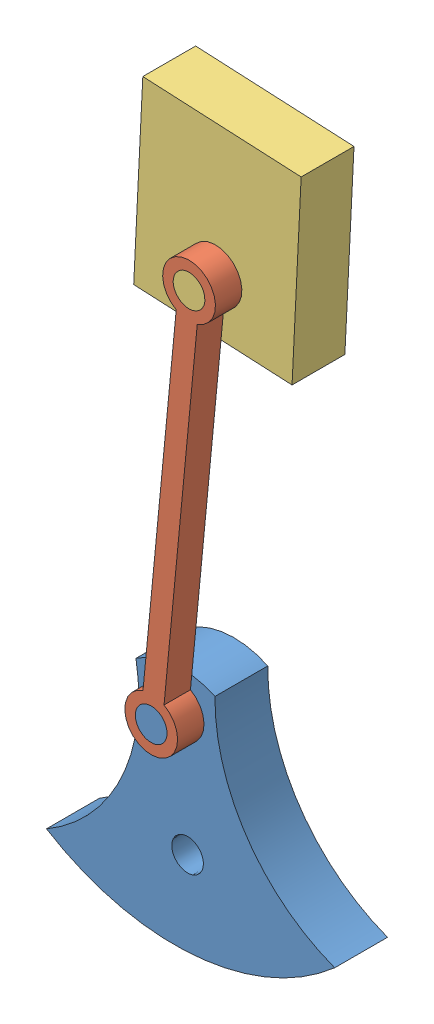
SolidWorks assembly c17-tut01.SLDASM, configuration Default (file format 5000). Lengths in mm.
Overall size (58.31 141.4 15).
3 component instances, 3 part files, 0 mates.
Components (placement in the parent):
- Block-Crank-1-1-1: Block-Crank-1-1.sldprt [Default] at (-1.8869 22.9225 0) x (0.996629 0.082038 0) z (0 0 1) size (54.72 45.93 15)
- Piston_rod-1-2-1: Piston_rod-1-2.sldprt [Default] at (5.2763 97.5796 0) x (0.995429 -0.095509 0) z (0 0 1) size (10 85 5)
- Piston_tank-1-3-1: Piston_tank-1-3.sldprt [Default] at (5.2763 97.5796 0) x (0.998786 -0.049263 0) z (0 0 1) size (30 35 15)
